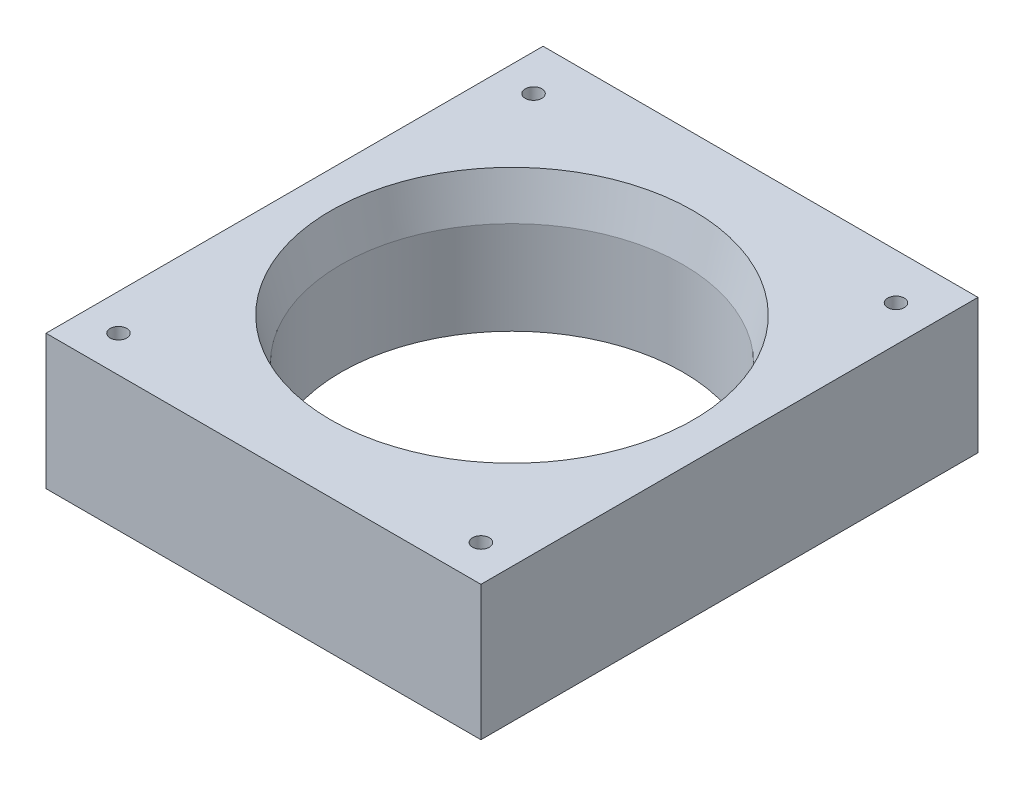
from build123d import *

# Parameters (mm, degrees)
SKETCH1_W               = 133.35
SKETCH1_H               = 152.4
BOSS_EXTRUDE1_DEPTH     = 41.275
SKETCH2_R               = 52.3875
CUT_EXTRUDE1_DEPTH      = 445.704080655
F_1_4_20_TAPPED_HOLE1_D = 5.1054
CHAMFER1_SIZE           = 3.175
CHAMFER1_SIZE2          = 12.7


with BuildPart() as part:
    # Sketch1 → Boss-Extrude1 (new body)
    with BuildSketch(Plane(origin=(0, -44.577, 0), x_dir=(-1, 0, 0), z_dir=(0, -1, 0))):
        with Locations((76.2, 342.900021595)):
            Rectangle(SKETCH1_W, SKETCH1_H)
    extrude(amount=-BOSS_EXTRUDE1_DEPTH)

    # Sketch2 → Cut-Extrude1 (cut, through all)
    with BuildSketch(Plane(origin=(0, -3.302, 0), x_dir=(1, 0, 0), z_dir=(0, 1, 0))):
        with Locations(Location((-76.2, 342.900021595, 0), (0, 0, 270))):
            Circle(SKETCH2_R)
    extrude(amount=-CUT_EXTRUDE1_DEPTH, mode=Mode.SUBTRACT)

    # 1_4-20 Tapped Hole1 (through all)
    with Locations(Plane(origin=(0, -44.577, 0), x_dir=(-1, 0, 0), z_dir=(0, -1, 0))):
        with Locations((20.6375, 277.812521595), (131.7625, 277.812521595), (131.7625, 405.066521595), (20.6375, 405.066521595)):
            Hole(F_1_4_20_TAPPED_HOLE1_D / 2)

    # Chamfer1
    chamfer1_edges = [part.edges().sort_by_distance(p)[0] for p in [
        (-76.2, -3.302, -395.287521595),
    ]]
    chamfer1_side = [part.faces().sort_by_distance(p)[0] for p in [
        (-76.2, -3.302, -268.725064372),
    ]]
    chamfer(chamfer1_edges, length=CHAMFER1_SIZE, length2=CHAMFER1_SIZE2, reference=chamfer1_side[0])


solid = part.part
